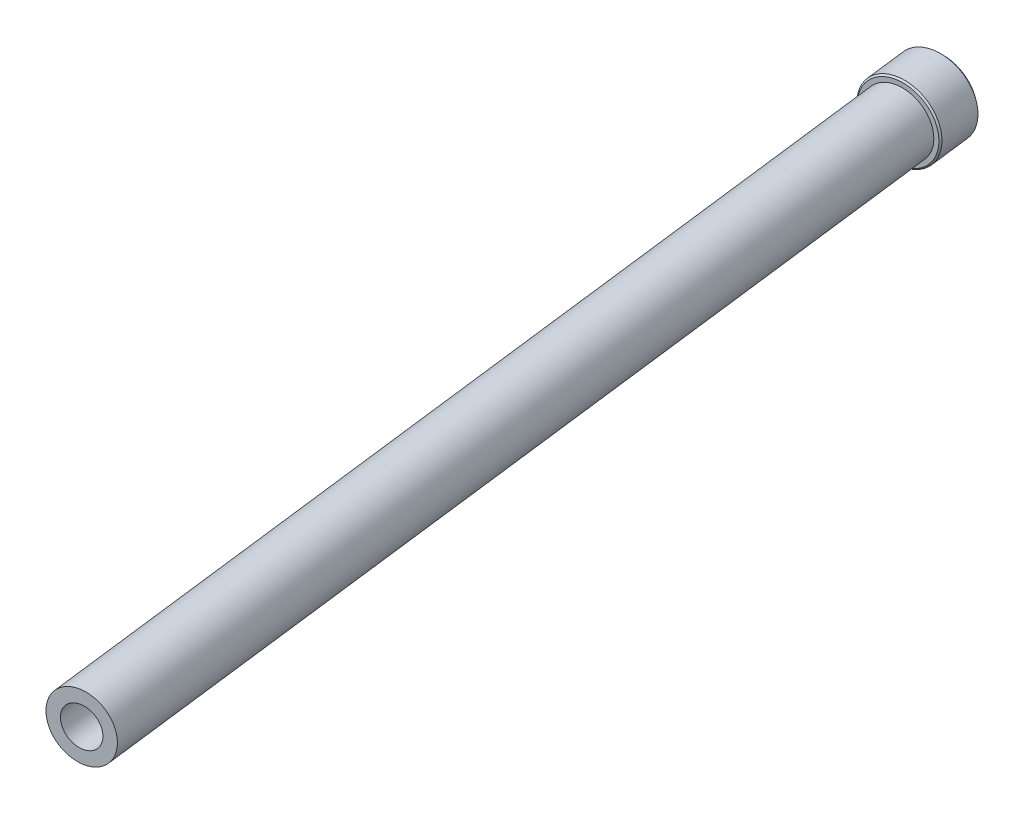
ISO-10303-21;
HEADER;
FILE_DESCRIPTION(('STEP AP214'),'2;1');
FILE_NAME('part.step','',(''),(''),'','','');
FILE_SCHEMA(('AUTOMOTIVE_DESIGN { 1 0 10303 214 1 1 1 1 }'));
ENDSEC;
DATA;
#1=APPLICATION_CONTEXT('core data for automotive mechanical design processes');
#2=APPLICATION_PROTOCOL_DEFINITION('international standard','automotive_design',2000,#1);
#3=PRODUCT_CONTEXT('',#1,'mechanical');
#4=PRODUCT('Part','Part','',(#3));
#5=PRODUCT_RELATED_PRODUCT_CATEGORY('part','',(#4));
#6=PRODUCT_DEFINITION_FORMATION('','',#4);
#7=PRODUCT_DEFINITION_CONTEXT('part definition',#1,'design');
#8=PRODUCT_DEFINITION('design','',#6,#7);
#9=PRODUCT_DEFINITION_SHAPE('','',#8);
#10=(LENGTH_UNIT() NAMED_UNIT(*) SI_UNIT(.MILLI.,.METRE.));
#11=(NAMED_UNIT(*) PLANE_ANGLE_UNIT() SI_UNIT($,.RADIAN.));
#12=(NAMED_UNIT(*) SI_UNIT($,.STERADIAN.) SOLID_ANGLE_UNIT());
#13=UNCERTAINTY_MEASURE_WITH_UNIT(LENGTH_MEASURE(1.E-05),#10,'distance_accuracy_value','');
#14=(GEOMETRIC_REPRESENTATION_CONTEXT(3) GLOBAL_UNCERTAINTY_ASSIGNED_CONTEXT((#13)) GLOBAL_UNIT_ASSIGNED_CONTEXT((#10,
#11,#12)) REPRESENTATION_CONTEXT('',''));
#15=CARTESIAN_POINT('',(0.,0.,0.));
#16=DIRECTION('',(0.,0.,1.));
#17=DIRECTION('',(1.,0.,0.));
#18=AXIS2_PLACEMENT_3D('',#15,#16,#17);
#19=CARTESIAN_POINT('',(8.47286332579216,-1.5482407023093E-13,-889.518716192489));
#20=DIRECTION('',(-0.122564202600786,0.,-0.992460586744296));
#21=DIRECTION('',(-0.992453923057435,0.00366450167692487,0.12256337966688));
#22=AXIS2_PLACEMENT_3D('',#19,#20,#21);
#23=CONICAL_SURFACE('',#22,24.,0.785398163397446);
#24=CARTESIAN_POINT('',(8.35029912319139,-1.55474591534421E-13,-890.511176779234));
#25=DIRECTION('',(0.122564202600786,0.,0.992460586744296));
#26=DIRECTION('',(0.992453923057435,-0.00366450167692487,-0.12256337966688));
#27=AXIS2_PLACEMENT_3D('',#24,#25,#26);
#28=CIRCLE('',#27,25.);
#29=CARTESIAN_POINT('',(-16.4610489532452,0.0916125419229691,-887.447092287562));
#30=VERTEX_POINT('',#29);
#31=EDGE_CURVE('E41',#30,#30,#28,.F.);
#32=CARTESIAN_POINT('',(8.47286332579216,-1.5482407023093E-13,-889.518716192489));
#33=DIRECTION('',(0.122564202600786,0.,0.992460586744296));
#34=DIRECTION('',(0.992453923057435,-0.00366450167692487,-0.12256337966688));
#35=AXIS2_PLACEMENT_3D('',#32,#33,#34);
#36=CIRCLE('',#35,24.);
#37=CARTESIAN_POINT('',(-15.3460308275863,0.0879480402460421,-886.577195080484));
#38=VERTEX_POINT('',#37);
#39=EDGE_CURVE('E34',#38,#38,#36,.T.);
#40=CARTESIAN_POINT('',(-16.4610489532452,0.0916125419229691,-887.447092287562));
#41=CARTESIAN_POINT('',(-16.4494341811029,0.0915743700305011,-887.438030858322));
#42=CARTESIAN_POINT('',(-16.4378194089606,0.0915361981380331,-887.428969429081));
#43=CARTESIAN_POINT('',(-16.4145898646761,0.0914598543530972,-887.4108465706));
#44=CARTESIAN_POINT('',(-16.4029750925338,0.0914216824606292,-887.40178514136));
#45=CARTESIAN_POINT('',(-16.3797455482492,0.0913453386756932,-887.383662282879));
#46=CARTESIAN_POINT('',(-16.3681307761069,0.0913071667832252,-887.374600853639));
#47=CARTESIAN_POINT('',(-16.3449012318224,0.0912308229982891,-887.356477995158));
#48=CARTESIAN_POINT('',(-16.3332864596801,0.0911926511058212,-887.347416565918));
#49=CARTESIAN_POINT('',(-16.3100569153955,0.0911163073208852,-887.329293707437));
#50=CARTESIAN_POINT('',(-16.2984421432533,0.0910781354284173,-887.320232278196));
#51=CARTESIAN_POINT('',(-16.2752125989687,0.0910017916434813,-887.302109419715));
#52=CARTESIAN_POINT('',(-16.2635978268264,0.0909636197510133,-887.293047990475));
#53=CARTESIAN_POINT('',(-16.2403682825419,0.0908872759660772,-887.274925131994));
#54=CARTESIAN_POINT('',(-16.2287535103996,0.0908491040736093,-887.265863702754));
#55=CARTESIAN_POINT('',(-16.205523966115,0.0907727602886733,-887.247740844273));
#56=CARTESIAN_POINT('',(-16.1939091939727,0.0907345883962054,-887.238679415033));
#57=CARTESIAN_POINT('',(-16.1706796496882,0.0906582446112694,-887.220556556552));
#58=CARTESIAN_POINT('',(-16.1590648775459,0.0906200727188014,-887.211495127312));
#59=CARTESIAN_POINT('',(-16.1358353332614,0.0905437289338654,-887.193372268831));
#60=CARTESIAN_POINT('',(-16.1242205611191,0.0905055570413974,-887.18431083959));
#61=CARTESIAN_POINT('',(-16.1009910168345,0.0904292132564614,-887.16618798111));
#62=CARTESIAN_POINT('',(-16.0893762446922,0.0903910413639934,-887.157126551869));
#63=CARTESIAN_POINT('',(-16.0661467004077,0.0903146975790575,-887.139003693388));
#64=CARTESIAN_POINT('',(-16.0545319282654,0.0902765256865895,-887.129942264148));
#65=CARTESIAN_POINT('',(-16.0313023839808,0.0902001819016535,-887.111819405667));
#66=CARTESIAN_POINT('',(-16.0196876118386,0.0901620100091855,-887.102757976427));
#67=CARTESIAN_POINT('',(-15.996458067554,0.0900856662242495,-887.084635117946));
#68=CARTESIAN_POINT('',(-15.9848432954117,0.0900474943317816,-887.075573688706));
#69=CARTESIAN_POINT('',(-15.9616137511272,0.0899711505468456,-887.057450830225));
#70=CARTESIAN_POINT('',(-15.9499989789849,0.0899329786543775,-887.048389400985));
#71=CARTESIAN_POINT('',(-15.9267694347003,0.0898566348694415,-887.030266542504));
#72=CARTESIAN_POINT('',(-15.915154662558,0.0898184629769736,-887.021205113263));
#73=CARTESIAN_POINT('',(-15.8919251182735,0.0897421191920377,-887.003082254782));
#74=CARTESIAN_POINT('',(-15.8803103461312,0.0897039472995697,-886.994020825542));
#75=CARTESIAN_POINT('',(-15.8570808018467,0.0896276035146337,-886.975897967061));
#76=CARTESIAN_POINT('',(-15.8454660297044,0.0895894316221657,-886.966836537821));
#77=CARTESIAN_POINT('',(-15.8222364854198,0.0895130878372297,-886.94871367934));
#78=CARTESIAN_POINT('',(-15.8106217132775,0.0894749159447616,-886.9396522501));
#79=CARTESIAN_POINT('',(-15.787392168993,0.0893985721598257,-886.921529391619));
#80=CARTESIAN_POINT('',(-15.7757773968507,0.0893604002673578,-886.912467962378));
#81=CARTESIAN_POINT('',(-15.7525478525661,0.0892840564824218,-886.894345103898));
#82=CARTESIAN_POINT('',(-15.7409330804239,0.0892458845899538,-886.885283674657));
#83=CARTESIAN_POINT('',(-15.7177035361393,0.0891695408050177,-886.867160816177));
#84=CARTESIAN_POINT('',(-15.706088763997,0.0891313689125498,-886.858099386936));
#85=CARTESIAN_POINT('',(-15.6828592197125,0.0890550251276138,-886.839976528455));
#86=CARTESIAN_POINT('',(-15.6712444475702,0.0890168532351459,-886.830915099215));
#87=CARTESIAN_POINT('',(-15.6480149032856,0.0889405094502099,-886.812792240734));
#88=CARTESIAN_POINT('',(-15.6364001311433,0.0889023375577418,-886.803730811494));
#89=CARTESIAN_POINT('',(-15.6131705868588,0.0888259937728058,-886.785607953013));
#90=CARTESIAN_POINT('',(-15.6015558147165,0.0887878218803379,-886.776546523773));
#91=CARTESIAN_POINT('',(-15.578326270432,0.088711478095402,-886.758423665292));
#92=CARTESIAN_POINT('',(-15.5667114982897,0.088673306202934,-886.749362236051));
#93=CARTESIAN_POINT('',(-15.5434819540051,0.088596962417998,-886.731239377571));
#94=CARTESIAN_POINT('',(-15.5318671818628,0.08855879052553,-886.72217794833));
#95=CARTESIAN_POINT('',(-15.5086376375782,0.088482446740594,-886.704055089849));
#96=CARTESIAN_POINT('',(-15.497022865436,0.0884442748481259,-886.694993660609));
#97=CARTESIAN_POINT('',(-15.4737933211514,0.08836793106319,-886.676870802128));
#98=CARTESIAN_POINT('',(-15.4621785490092,0.0883297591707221,-886.667809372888));
#99=CARTESIAN_POINT('',(-15.4389490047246,0.0882534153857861,-886.649686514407));
#100=CARTESIAN_POINT('',(-15.4273342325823,0.0882152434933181,-886.640625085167));
#101=CARTESIAN_POINT('',(-15.4041046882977,0.088138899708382,-886.622502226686));
#102=CARTESIAN_POINT('',(-15.3924899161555,0.0881007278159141,-886.613440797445));
#103=CARTESIAN_POINT('',(-15.3692603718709,0.0880243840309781,-886.595317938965));
#104=CARTESIAN_POINT('',(-15.3576455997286,0.0879862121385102,-886.586256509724));
#105=CARTESIAN_POINT('',(-15.3460308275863,0.0879480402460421,-886.577195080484));
#106=B_SPLINE_CURVE_WITH_KNOTS('',3,(#40,#41,#42,#43,#44,#45,#46,#47,#48,#49,#50,#51,#52,#53,
#54,#55,#56,#57,#58,#59,#60,#61,#62,#63,#64,#65,#66,#67,#68,#69,#70,#71,#72,#73,#74,#75,#76,#77,
#78,#79,#80,#81,#82,#83,#84,#85,#86,#87,#88,#89,#90,#91,#92,#93,#94,#95,#96,#97,#98,#99,#100,
#101,#102,#103,#104,#105),.UNSPECIFIED.,.F.,.F.,(4,2,2,2,2,2,2,2,2,2,2,2,2,2,2,2,2,2,2,2,2,2,2,
2,2,2,2,2,2,2,2,2,4),(0.,0.0441941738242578,0.08838834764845,0.132582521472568,
0.176776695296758,0.220970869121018,0.265165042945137,0.309359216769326,0.353553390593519,
0.397747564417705,0.441941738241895,0.486135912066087,0.530330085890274,0.574524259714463,
0.618718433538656,0.662912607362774,0.707106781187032,0.751300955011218,0.795495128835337,
0.839689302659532,0.883883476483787,0.928077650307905,0.9722718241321,1.01646599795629,
1.06066017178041,1.10485434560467,1.14904851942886,1.19324269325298,1.23743686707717,
1.28163104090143,1.32582521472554,1.37001938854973,1.41421356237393),.UNSPECIFIED.);
#107=EDGE_CURVE('BSEAM14',#30,#38,#106,.T.);
#108=ORIENTED_EDGE('',*,*,#31,.F.);
#109=ORIENTED_EDGE('',*,*,#39,.F.);
#110=ORIENTED_EDGE('',*,*,#107,.T.);
#111=ORIENTED_EDGE('',*,*,#107,.F.);
#112=EDGE_LOOP('',(#108,#110,#109,#111));
#113=FACE_BOUND('',#112,.T.);
#114=ADVANCED_FACE('F14',(#113),#23,.T.);
#115=CARTESIAN_POINT('',(8.47286332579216,-1.5482407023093E-13,-889.518716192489));
#116=DIRECTION('',(0.122564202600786,0.,0.992460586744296));
#117=DIRECTION('',(0.992453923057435,-0.00366450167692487,-0.12256337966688));
#118=AXIS2_PLACEMENT_3D('',#115,#116,#117);
#119=PLANE('',#118);
#120=ORIENTED_EDGE('',*,*,#39,.T.);
#121=EDGE_LOOP('',(#120));
#122=FACE_BOUND('',#121,.T.);
#123=CARTESIAN_POINT('',(8.47286332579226,-1.55257751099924E-13,-889.518716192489));
#124=DIRECTION('',(0.122564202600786,0.,0.992460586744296));
#125=DIRECTION('',(0.992453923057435,-0.00366450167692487,-0.12256337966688));
#126=AXIS2_PLACEMENT_3D('',#123,#124,#125);
#127=CIRCLE('',#126,21.);
#128=CARTESIAN_POINT('',(29.3143957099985,-0.0769545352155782,-892.092547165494));
#129=VERTEX_POINT('',#128);
#130=EDGE_CURVE('E9',#129,#129,#127,.F.);
#131=ORIENTED_EDGE('',*,*,#130,.T.);
#132=EDGE_LOOP('',(#131));
#133=FACE_BOUND('',#132,.T.);
#134=ADVANCED_FACE('F72',(#122,#133),#119,.T.);
#135=CARTESIAN_POINT('',(4.79593724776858,-1.53956708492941E-13,-919.292533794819));
#136=DIRECTION('',(0.122564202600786,0.,0.992460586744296));
#137=DIRECTION('',(0.992453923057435,-0.00366450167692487,-0.12256337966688));
#138=AXIS2_PLACEMENT_3D('',#135,#136,#137);
#139=CYLINDRICAL_SURFACE('',#138,25.);
#140=CARTESIAN_POINT('',(5.02513230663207,-1.53956708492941E-13,-917.436632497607));
#141=DIRECTION('',(-0.122564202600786,0.,-0.992460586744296));
#142=DIRECTION('',(-0.992453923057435,0.00366450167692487,0.12256337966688));
#143=AXIS2_PLACEMENT_3D('',#140,#141,#142);
#144=CIRCLE('',#143,25.);
#145=CARTESIAN_POINT('',(29.8364803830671,-0.0916125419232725,-920.500716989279));
#146=VERTEX_POINT('',#145);
#147=EDGE_CURVE('E18',#146,#146,#144,.F.);
#148=ORIENTED_EDGE('',*,*,#147,.T.);
#149=EDGE_LOOP('',(#148));
#150=FACE_BOUND('',#149,.T.);
#151=ORIENTED_EDGE('',*,*,#31,.T.);
#152=EDGE_LOOP('',(#151));
#153=FACE_BOUND('',#152,.T.);
#154=ADVANCED_FACE('F79',(#150,#153),#139,.T.);
#155=CARTESIAN_POINT('',(4.78000390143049,-1.53523027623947E-13,-919.421553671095));
#156=DIRECTION('',(-0.122564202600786,0.,-0.992460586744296));
#157=DIRECTION('',(-0.992453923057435,0.00366450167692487,0.12256337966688));
#158=AXIS2_PLACEMENT_3D('',#155,#156,#157);
#159=PLANE('',#158);
#160=CARTESIAN_POINT('',(4.78000390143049,-1.53523027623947E-13,-919.421553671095));
#161=DIRECTION('',(-0.122564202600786,0.,-0.992460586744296));
#162=DIRECTION('',(-0.992453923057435,0.00366450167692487,0.12256337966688));
#163=AXIS2_PLACEMENT_3D('',#160,#161,#162);
#164=CIRCLE('',#163,23.);
#165=CARTESIAN_POINT('',(27.6064441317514,-0.0842835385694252,-922.240511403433));
#166=VERTEX_POINT('',#165);
#167=EDGE_CURVE('E26',#166,#166,#164,.T.);
#168=ORIENTED_EDGE('',*,*,#167,.T.);
#169=EDGE_LOOP('',(#168));
#170=FACE_BOUND('',#169,.T.);
#171=CARTESIAN_POINT('',(4.78000390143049,-1.53523027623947E-13,-919.421553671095));
#172=DIRECTION('',(-0.122564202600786,0.,-0.992460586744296));
#173=DIRECTION('',(-0.992453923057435,0.00366450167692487,0.12256337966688));
#174=AXIS2_PLACEMENT_3D('',#171,#172,#173);
#175=CIRCLE('',#174,7.5);
#176=CARTESIAN_POINT('',(12.2234083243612,-0.0274837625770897,-920.340779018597));
#177=VERTEX_POINT('',#176);
#178=EDGE_CURVE('E31',#177,#177,#175,.T.);
#179=ORIENTED_EDGE('',*,*,#178,.F.);
#180=EDGE_LOOP('',(#179));
#181=FACE_BOUND('',#180,.T.);
#182=ADVANCED_FACE('F51',(#170,#181),#159,.T.);
#183=CARTESIAN_POINT('',(8.47286332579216,-1.5482407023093E-13,-889.518716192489));
#184=DIRECTION('',(0.122564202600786,0.,0.992460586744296));
#185=DIRECTION('',(0.992453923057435,-0.00366450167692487,-0.12256337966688));
#186=AXIS2_PLACEMENT_3D('',#183,#184,#185);
#187=CYLINDRICAL_SURFACE('',#186,7.5);
#188=CARTESIAN_POINT('',(4.35102919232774,-1.53523027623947E-13,-922.8951657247));
#189=DIRECTION('',(-0.122564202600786,0.,-0.992460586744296));
#190=DIRECTION('',(-0.992453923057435,0.00366450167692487,0.12256337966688));
#191=AXIS2_PLACEMENT_3D('',#188,#189,#190);
#192=CIRCLE('',#191,7.5);
#193=CARTESIAN_POINT('',(11.7944336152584,-0.0274837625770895,-923.814391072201));
#194=VERTEX_POINT('',#193);
#195=EDGE_CURVE('E28',#194,#194,#192,.T.);
#196=CARTESIAN_POINT('',(12.2234083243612,-0.0274837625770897,-920.340779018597));
#197=CARTESIAN_POINT('',(12.2189398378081,-0.0274837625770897,-920.376962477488));
#198=CARTESIAN_POINT('',(12.2144713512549,-0.0274837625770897,-920.41314593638));
#199=CARTESIAN_POINT('',(12.2055343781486,-0.0274837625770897,-920.485512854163));
#200=CARTESIAN_POINT('',(12.2010658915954,-0.0274837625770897,-920.521696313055));
#201=CARTESIAN_POINT('',(12.1921289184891,-0.0274837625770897,-920.594063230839));
#202=CARTESIAN_POINT('',(12.187660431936,-0.0274837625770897,-920.63024668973));
#203=CARTESIAN_POINT('',(12.1787234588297,-0.0274837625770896,-920.702613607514));
#204=CARTESIAN_POINT('',(12.1742549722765,-0.0274837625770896,-920.738797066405));
#205=CARTESIAN_POINT('',(12.1653179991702,-0.0274837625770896,-920.811163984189));
#206=CARTESIAN_POINT('',(12.160849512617,-0.0274837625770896,-920.847347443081));
#207=CARTESIAN_POINT('',(12.1519125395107,-0.0274837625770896,-920.919714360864));
#208=CARTESIAN_POINT('',(12.1474440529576,-0.0274837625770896,-920.955897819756));
#209=CARTESIAN_POINT('',(12.1385070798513,-0.0274837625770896,-921.028264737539));
#210=CARTESIAN_POINT('',(12.1340385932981,-0.0274837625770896,-921.064448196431));
#211=CARTESIAN_POINT('',(12.1251016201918,-0.0274837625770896,-921.136815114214));
#212=CARTESIAN_POINT('',(12.1206331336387,-0.0274837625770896,-921.172998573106));
#213=CARTESIAN_POINT('',(12.1116961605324,-0.0274837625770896,-921.24536549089));
#214=CARTESIAN_POINT('',(12.1072276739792,-0.0274837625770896,-921.281548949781));
#215=CARTESIAN_POINT('',(12.0982907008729,-0.0274837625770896,-921.353915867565));
#216=CARTESIAN_POINT('',(12.0938222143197,-0.0274837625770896,-921.390099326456));
#217=CARTESIAN_POINT('',(12.0848852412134,-0.0274837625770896,-921.46246624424));
#218=CARTESIAN_POINT('',(12.0804167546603,-0.0274837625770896,-921.498649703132));
#219=CARTESIAN_POINT('',(12.071479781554,-0.0274837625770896,-921.571016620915));
#220=CARTESIAN_POINT('',(12.0670112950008,-0.0274837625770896,-921.607200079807));
#221=CARTESIAN_POINT('',(12.0580743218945,-0.0274837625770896,-921.67956699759));
#222=CARTESIAN_POINT('',(12.0536058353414,-0.0274837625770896,-921.715750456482));
#223=CARTESIAN_POINT('',(12.0446688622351,-0.0274837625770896,-921.788117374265));
#224=CARTESIAN_POINT('',(12.0402003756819,-0.0274837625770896,-921.824300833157));
#225=CARTESIAN_POINT('',(12.0312634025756,-0.0274837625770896,-921.89666775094));
#226=CARTESIAN_POINT('',(12.0267949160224,-0.0274837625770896,-921.932851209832));
#227=CARTESIAN_POINT('',(12.0178579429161,-0.0274837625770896,-922.005218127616));
#228=CARTESIAN_POINT('',(12.013389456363,-0.0274837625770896,-922.041401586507));
#229=CARTESIAN_POINT('',(12.0044524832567,-0.0274837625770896,-922.113768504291));
#230=CARTESIAN_POINT('',(11.9999839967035,-0.0274837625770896,-922.149951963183));
#231=CARTESIAN_POINT('',(11.9910470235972,-0.0274837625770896,-922.222318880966));
#232=CARTESIAN_POINT('',(11.9865785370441,-0.0274837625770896,-922.258502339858));
#233=CARTESIAN_POINT('',(11.9776415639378,-0.0274837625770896,-922.330869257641));
#234=CARTESIAN_POINT('',(11.9731730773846,-0.0274837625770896,-922.367052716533));
#235=CARTESIAN_POINT('',(11.9642361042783,-0.0274837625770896,-922.439419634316));
#236=CARTESIAN_POINT('',(11.9597676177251,-0.0274837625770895,-922.475603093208));
#237=CARTESIAN_POINT('',(11.9508306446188,-0.0274837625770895,-922.547970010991));
#238=CARTESIAN_POINT('',(11.9463621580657,-0.0274837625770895,-922.584153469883));
#239=CARTESIAN_POINT('',(11.9374251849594,-0.0274837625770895,-922.656520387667));
#240=CARTESIAN_POINT('',(11.9329566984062,-0.0274837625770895,-922.692703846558));
#241=CARTESIAN_POINT('',(11.9240197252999,-0.0274837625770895,-922.765070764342));
#242=CARTESIAN_POINT('',(11.9195512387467,-0.0274837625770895,-922.801254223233));
#243=CARTESIAN_POINT('',(11.9106142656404,-0.0274837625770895,-922.873621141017));
#244=CARTESIAN_POINT('',(11.9061457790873,-0.0274837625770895,-922.909804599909));
#245=CARTESIAN_POINT('',(11.897208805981,-0.0274837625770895,-922.982171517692));
#246=CARTESIAN_POINT('',(11.8927403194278,-0.0274837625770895,-923.018354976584));
#247=CARTESIAN_POINT('',(11.8838033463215,-0.0274837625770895,-923.090721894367));
#248=CARTESIAN_POINT('',(11.8793348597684,-0.0274837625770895,-923.126905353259));
#249=CARTESIAN_POINT('',(11.8703978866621,-0.0274837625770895,-923.199272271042));
#250=CARTESIAN_POINT('',(11.8659294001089,-0.0274837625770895,-923.235455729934));
#251=CARTESIAN_POINT('',(11.8569924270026,-0.0274837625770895,-923.307822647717));
#252=CARTESIAN_POINT('',(11.8525239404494,-0.0274837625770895,-923.344006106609));
#253=CARTESIAN_POINT('',(11.8435869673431,-0.0274837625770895,-923.416373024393));
#254=CARTESIAN_POINT('',(11.83911848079,-0.0274837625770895,-923.452556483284));
#255=CARTESIAN_POINT('',(11.8301815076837,-0.0274837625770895,-923.524923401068));
#256=CARTESIAN_POINT('',(11.8257130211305,-0.0274837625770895,-923.56110685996));
#257=CARTESIAN_POINT('',(11.8167760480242,-0.0274837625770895,-923.633473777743));
#258=CARTESIAN_POINT('',(11.8123075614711,-0.0274837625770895,-923.669657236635));
#259=CARTESIAN_POINT('',(11.8033705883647,-0.0274837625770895,-923.742024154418));
#260=CARTESIAN_POINT('',(11.7989021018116,-0.0274837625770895,-923.77820761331));
#261=CARTESIAN_POINT('',(11.7944336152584,-0.0274837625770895,-923.814391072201));
#262=B_SPLINE_CURVE_WITH_KNOTS('',3,(#196,#197,#198,#199,#200,#201,#202,#203,#204,#205,#206,
#207,#208,#209,#210,#211,#212,#213,#214,#215,#216,#217,#218,#219,#220,#221,#222,#223,#224,#225,
#226,#227,#228,#229,#230,#231,#232,#233,#234,#235,#236,#237,#238,#239,#240,#241,#242,#243,#244,
#245,#246,#247,#248,#249,#250,#251,#252,#253,#254,#255,#256,#257,#258,#259,#260,#261),
.UNSPECIFIED.,.F.,.F.,(4,2,2,2,2,2,2,2,2,2,2,2,2,2,2,2,2,2,2,2,2,2,2,2,2,2,2,2,2,2,2,2,4),(0.,
0.109374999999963,0.218749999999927,0.328125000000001,0.437499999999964,0.546874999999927,
0.656250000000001,0.765624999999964,0.874999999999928,0.984375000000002,1.09374999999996,
1.20312499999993,1.3125,1.42187499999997,1.53124999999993,1.640625,1.74999999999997,
1.85937499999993,1.96875,2.07812499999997,2.18749999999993,2.296875,2.40624999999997,
2.51562499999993,2.625,2.73437499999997,2.84374999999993,2.953125,3.06249999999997,
3.17187499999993,3.28125,3.39062499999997,3.49999999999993),.UNSPECIFIED.);
#263=EDGE_CURVE('BSEAM67',#177,#194,#262,.T.);
#264=ORIENTED_EDGE('',*,*,#178,.T.);
#265=ORIENTED_EDGE('',*,*,#195,.F.);
#266=ORIENTED_EDGE('',*,*,#263,.T.);
#267=ORIENTED_EDGE('',*,*,#263,.F.);
#268=EDGE_LOOP('',(#264,#266,#265,#267));
#269=FACE_BOUND('',#268,.T.);
#270=ADVANCED_FACE('F67',(#269),#187,.T.);
#271=CARTESIAN_POINT('',(4.35102919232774,-1.53523027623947E-13,-922.8951657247));
#272=DIRECTION('',(-0.122564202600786,0.,-0.992460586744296));
#273=DIRECTION('',(-0.992453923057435,0.00366450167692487,0.12256337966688));
#274=AXIS2_PLACEMENT_3D('',#271,#272,#273);
#275=PLANE('',#274);
#276=ORIENTED_EDGE('',*,*,#195,.T.);
#277=EDGE_LOOP('',(#276));
#278=FACE_BOUND('',#277,.T.);
#279=ADVANCED_FACE('F56',(#278),#275,.T.);
#280=CARTESIAN_POINT('',(4.78000390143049,-1.53523027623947E-13,-919.421553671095));
#281=DIRECTION('',(0.122564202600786,0.,0.992460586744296));
#282=DIRECTION('',(0.992453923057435,-0.00366450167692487,-0.12256337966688));
#283=AXIS2_PLACEMENT_3D('',#280,#281,#282);
#284=CONICAL_SURFACE('',#283,23.,0.785398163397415);
#285=CARTESIAN_POINT('',(29.8364803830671,-0.0916125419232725,-920.500716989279));
#286=CARTESIAN_POINT('',(29.8132508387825,-0.0915361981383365,-920.51883984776));
#287=CARTESIAN_POINT('',(29.790021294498,-0.0914598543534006,-920.53696270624));
#288=CARTESIAN_POINT('',(29.743562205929,-0.0913071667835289,-920.573208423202));
#289=CARTESIAN_POINT('',(29.7203326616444,-0.091230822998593,-920.591331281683));
#290=CARTESIAN_POINT('',(29.6738735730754,-0.0910781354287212,-920.627576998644));
#291=CARTESIAN_POINT('',(29.6506440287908,-0.0910017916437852,-920.645699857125));
#292=CARTESIAN_POINT('',(29.6041849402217,-0.0908491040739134,-920.681945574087));
#293=CARTESIAN_POINT('',(29.5809553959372,-0.0907727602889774,-920.700068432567));
#294=CARTESIAN_POINT('',(29.5344963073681,-0.0906200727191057,-920.736314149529));
#295=CARTESIAN_POINT('',(29.5112667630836,-0.0905437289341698,-920.75443700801));
#296=CARTESIAN_POINT('',(29.4648076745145,-0.090391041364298,-920.790682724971));
#297=CARTESIAN_POINT('',(29.44157813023,-0.0903146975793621,-920.808805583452));
#298=CARTESIAN_POINT('',(29.3951190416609,-0.0901620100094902,-920.845051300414));
#299=CARTESIAN_POINT('',(29.3718894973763,-0.0900856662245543,-920.863174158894));
#300=CARTESIAN_POINT('',(29.3254304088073,-0.0899329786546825,-920.899419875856));
#301=CARTESIAN_POINT('',(29.3022008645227,-0.0898566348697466,-920.917542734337));
#302=CARTESIAN_POINT('',(29.2557417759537,-0.0897039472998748,-920.953788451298));
#303=CARTESIAN_POINT('',(29.2325122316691,-0.0896276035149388,-920.971911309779));
#304=CARTESIAN_POINT('',(29.1860531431,-0.089474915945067,-921.00815702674));
#305=CARTESIAN_POINT('',(29.1628235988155,-0.0893985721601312,-921.026279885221));
#306=CARTESIAN_POINT('',(29.1163645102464,-0.0892458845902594,-921.062525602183));
#307=CARTESIAN_POINT('',(29.0931349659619,-0.0891695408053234,-921.080648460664));
#308=CARTESIAN_POINT('',(29.0466758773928,-0.0890168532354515,-921.116894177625));
#309=CARTESIAN_POINT('',(29.0234463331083,-0.0889405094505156,-921.135017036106));
#310=CARTESIAN_POINT('',(28.9769872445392,-0.0887878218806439,-921.171262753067));
#311=CARTESIAN_POINT('',(28.9537577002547,-0.088711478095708,-921.189385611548));
#312=CARTESIAN_POINT('',(28.9072986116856,-0.0885587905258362,-921.22563132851));
#313=CARTESIAN_POINT('',(28.884069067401,-0.0884824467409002,-921.243754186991));
#314=CARTESIAN_POINT('',(28.837609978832,-0.0883297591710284,-921.279999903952));
#315=CARTESIAN_POINT('',(28.8143804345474,-0.0882534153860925,-921.298122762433));
#316=CARTESIAN_POINT('',(28.7679213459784,-0.0881007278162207,-921.334368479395));
#317=CARTESIAN_POINT('',(28.7446918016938,-0.0880243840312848,-921.352491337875));
#318=CARTESIAN_POINT('',(28.6982327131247,-0.0878716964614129,-921.388737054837));
#319=CARTESIAN_POINT('',(28.6750031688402,-0.087795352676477,-921.406859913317));
#320=CARTESIAN_POINT('',(28.6285440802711,-0.0876426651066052,-921.443105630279));
#321=CARTESIAN_POINT('',(28.6053145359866,-0.0875663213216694,-921.46122848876));
#322=CARTESIAN_POINT('',(28.5588554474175,-0.0874136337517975,-921.497474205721));
#323=CARTESIAN_POINT('',(28.535625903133,-0.0873372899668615,-921.515597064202));
#324=CARTESIAN_POINT('',(28.4891668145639,-0.0871846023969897,-921.551842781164));
#325=CARTESIAN_POINT('',(28.4659372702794,-0.0871082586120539,-921.569965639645));
#326=CARTESIAN_POINT('',(28.4194781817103,-0.0869555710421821,-921.606211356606));
#327=CARTESIAN_POINT('',(28.3962486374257,-0.0868792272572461,-921.624334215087));
#328=CARTESIAN_POINT('',(28.3497895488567,-0.0867265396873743,-921.660579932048));
#329=CARTESIAN_POINT('',(28.3265600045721,-0.0866501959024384,-921.678702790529));
#330=CARTESIAN_POINT('',(28.280100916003,-0.0864975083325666,-921.714948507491));
#331=CARTESIAN_POINT('',(28.2568713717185,-0.0864211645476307,-921.733071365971));
#332=CARTESIAN_POINT('',(28.2104122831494,-0.0862684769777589,-921.769317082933));
#333=CARTESIAN_POINT('',(28.1871827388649,-0.0861921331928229,-921.787439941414));
#334=CARTESIAN_POINT('',(28.1407236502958,-0.0860394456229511,-921.823685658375));
#335=CARTESIAN_POINT('',(28.1174941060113,-0.0859631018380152,-921.841808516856));
#336=CARTESIAN_POINT('',(28.0710350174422,-0.0858104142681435,-921.878054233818));
#337=CARTESIAN_POINT('',(28.0478054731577,-0.0857340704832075,-921.896177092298));
#338=CARTESIAN_POINT('',(28.0013463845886,-0.0855813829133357,-921.93242280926));
#339=CARTESIAN_POINT('',(27.978116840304,-0.0855050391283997,-921.950545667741));
#340=CARTESIAN_POINT('',(27.931657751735,-0.0853523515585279,-921.986791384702));
#341=CARTESIAN_POINT('',(27.9084282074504,-0.0852760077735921,-922.004914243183));
#342=CARTESIAN_POINT('',(27.8619691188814,-0.0851233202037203,-922.041159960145));
#343=CARTESIAN_POINT('',(27.8387395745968,-0.0850469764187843,-922.059282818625));
#344=CARTESIAN_POINT('',(27.7922804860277,-0.0848942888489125,-922.095528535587));
#345=CARTESIAN_POINT('',(27.7690509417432,-0.0848179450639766,-922.113651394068));
#346=CARTESIAN_POINT('',(27.7225918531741,-0.0846652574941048,-922.149897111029));
#347=CARTESIAN_POINT('',(27.6993623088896,-0.0845889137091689,-922.16801996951));
#348=CARTESIAN_POINT('',(27.6529032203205,-0.084436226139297,-922.204265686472));
#349=CARTESIAN_POINT('',(27.6296736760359,-0.084359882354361,-922.222388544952));
#350=CARTESIAN_POINT('',(27.6064441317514,-0.0842835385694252,-922.240511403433));
#351=B_SPLINE_CURVE_WITH_KNOTS('',3,(#285,#286,#287,#288,#289,#290,#291,#292,#293,#294,#295,
#296,#297,#298,#299,#300,#301,#302,#303,#304,#305,#306,#307,#308,#309,#310,#311,#312,#313,#314,
#315,#316,#317,#318,#319,#320,#321,#322,#323,#324,#325,#326,#327,#328,#329,#330,#331,#332,#333,
#334,#335,#336,#337,#338,#339,#340,#341,#342,#343,#344,#345,#346,#347,#348,#349,#350),
.UNSPECIFIED.,.F.,.F.,(4,2,2,2,2,2,2,2,2,2,2,2,2,2,2,2,2,2,2,2,2,2,2,2,2,2,2,2,2,2,2,2,4),(0.,
0.0883883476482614,0.176776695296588,0.265165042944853,0.353553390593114,0.441941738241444,
0.530330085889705,0.618718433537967,0.707106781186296,0.795495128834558,0.883883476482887,
0.972271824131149,1.06066017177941,1.14904851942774,1.237436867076,1.32582521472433,
1.41421356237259,1.50260191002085,1.59099025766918,1.67937860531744,1.76776695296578,
1.85615530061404,1.9445436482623,2.03293199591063,2.12132034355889,2.20970869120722,
2.29809703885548,2.38648538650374,2.47487373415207,2.56326208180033,2.65165042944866,
2.74003877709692,2.82842712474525),.UNSPECIFIED.);
#352=EDGE_CURVE('BSEAM16',#146,#166,#351,.T.);
#353=ORIENTED_EDGE('',*,*,#147,.F.);
#354=ORIENTED_EDGE('',*,*,#167,.F.);
#355=ORIENTED_EDGE('',*,*,#352,.T.);
#356=ORIENTED_EDGE('',*,*,#352,.F.);
#357=EDGE_LOOP('',(#353,#355,#354,#356));
#358=FACE_BOUND('',#357,.T.);
#359=ADVANCED_FACE('F16',(#358),#284,.T.);
#360=CARTESIAN_POINT('',(6.02157927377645,-1.53739868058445E-13,-909.367927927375));
#361=DIRECTION('',(-0.122564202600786,0.,-0.992460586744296));
#362=DIRECTION('',(-0.992453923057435,0.00366450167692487,0.12256337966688));
#363=AXIS2_PLACEMENT_3D('',#360,#361,#362);
#364=PLANE('',#363);
#365=CARTESIAN_POINT('',(6.02157927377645,-1.53739868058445E-13,-909.367927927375));
#366=DIRECTION('',(-0.122564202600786,0.,-0.992460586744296));
#367=DIRECTION('',(-0.992453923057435,0.00366450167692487,0.12256337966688));
#368=AXIS2_PLACEMENT_3D('',#365,#366,#367);
#369=CIRCLE('',#368,12.5);
#370=CARTESIAN_POINT('',(6.06704019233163,12.4999160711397,-909.37354213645));
#371=VERTEX_POINT('',#370);
#372=EDGE_CURVE('E35',#371,#371,#369,.F.);
#373=ORIENTED_EDGE('',*,*,#372,.T.);
#374=EDGE_LOOP('',(#373));
#375=FACE_BOUND('',#374,.T.);
#376=ADVANCED_FACE('F55',(#375),#364,.F.);
#377=CARTESIAN_POINT('',(76.4959957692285,-1.86916454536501E-13,-338.703090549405));
#378=DIRECTION('',(0.122564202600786,0.,0.992460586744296));
#379=DIRECTION('',(0.00363687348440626,0.999993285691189,-0.000449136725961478));
#380=AXIS2_PLACEMENT_3D('',#377,#378,#379);
#381=CYLINDRICAL_SURFACE('',#380,12.5);
#382=CARTESIAN_POINT('',(83.8498479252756,-1.89301699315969E-13,-279.155455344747));
#383=DIRECTION('',(-0.122564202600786,0.,-0.992460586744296));
#384=DIRECTION('',(-0.992453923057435,0.00366450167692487,0.12256337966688));
#385=AXIS2_PLACEMENT_3D('',#382,#383,#384);
#386=CIRCLE('',#385,12.5);
#387=CARTESIAN_POINT('',(83.8953088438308,12.4999160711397,-279.161069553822));
#388=VERTEX_POINT('',#387);
#389=EDGE_CURVE('E38',#388,#388,#386,.T.);
#390=CARTESIAN_POINT('',(83.8953088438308,12.4999160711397,-279.161069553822));
#391=CARTESIAN_POINT('',(83.0845977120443,12.4999160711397,-285.725782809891));
#392=CARTESIAN_POINT('',(82.2738865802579,12.4999160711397,-292.29049606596));
#393=CARTESIAN_POINT('',(80.652464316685,12.4999160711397,-305.419922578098));
#394=CARTESIAN_POINT('',(79.8417531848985,12.4999160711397,-311.984635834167));
#395=CARTESIAN_POINT('',(78.2203309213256,12.4999160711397,-325.114062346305));
#396=CARTESIAN_POINT('',(77.4096197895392,12.4999160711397,-331.678775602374));
#397=CARTESIAN_POINT('',(75.7881975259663,12.4999160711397,-344.808202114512));
#398=CARTESIAN_POINT('',(74.9774863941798,12.4999160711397,-351.372915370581));
#399=CARTESIAN_POINT('',(73.3560641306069,12.4999160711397,-364.502341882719));
#400=CARTESIAN_POINT('',(72.5453529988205,12.4999160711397,-371.067055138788));
#401=CARTESIAN_POINT('',(70.9239307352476,12.4999160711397,-384.196481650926));
#402=CARTESIAN_POINT('',(70.1132196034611,12.4999160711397,-390.761194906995));
#403=CARTESIAN_POINT('',(68.4917973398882,12.4999160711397,-403.890621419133));
#404=CARTESIAN_POINT('',(67.6810862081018,12.4999160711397,-410.455334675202));
#405=CARTESIAN_POINT('',(66.0596639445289,12.4999160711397,-423.584761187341));
#406=CARTESIAN_POINT('',(65.2489528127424,12.4999160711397,-430.14947444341));
#407=CARTESIAN_POINT('',(63.6275305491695,12.4999160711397,-443.278900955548));
#408=CARTESIAN_POINT('',(62.8168194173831,12.4999160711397,-449.843614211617));
#409=CARTESIAN_POINT('',(61.1953971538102,12.4999160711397,-462.973040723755));
#410=CARTESIAN_POINT('',(60.3846860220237,12.4999160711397,-469.537753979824));
#411=CARTESIAN_POINT('',(58.7632637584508,12.4999160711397,-482.667180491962));
#412=CARTESIAN_POINT('',(57.9525526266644,12.4999160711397,-489.231893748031));
#413=CARTESIAN_POINT('',(56.3311303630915,12.4999160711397,-502.361320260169));
#414=CARTESIAN_POINT('',(55.520419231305,12.4999160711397,-508.926033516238));
#415=CARTESIAN_POINT('',(53.8989969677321,12.4999160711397,-522.055460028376));
#416=CARTESIAN_POINT('',(53.0882858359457,12.4999160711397,-528.620173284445));
#417=CARTESIAN_POINT('',(51.4668635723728,12.4999160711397,-541.749599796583));
#418=CARTESIAN_POINT('',(50.6561524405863,12.4999160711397,-548.314313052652));
#419=CARTESIAN_POINT('',(49.0347301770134,12.4999160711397,-561.44373956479));
#420=CARTESIAN_POINT('',(48.224019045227,12.4999160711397,-568.00845282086));
#421=CARTESIAN_POINT('',(46.6025967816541,12.4999160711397,-581.137879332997));
#422=CARTESIAN_POINT('',(45.7918856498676,12.4999160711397,-587.702592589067));
#423=CARTESIAN_POINT('',(44.1704633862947,12.4999160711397,-600.832019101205));
#424=CARTESIAN_POINT('',(43.3597522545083,12.4999160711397,-607.396732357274));
#425=CARTESIAN_POINT('',(41.7383299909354,12.4999160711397,-620.526158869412));
#426=CARTESIAN_POINT('',(40.9276188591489,12.4999160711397,-627.090872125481));
#427=CARTESIAN_POINT('',(39.306196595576,12.4999160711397,-640.220298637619));
#428=CARTESIAN_POINT('',(38.4954854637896,12.4999160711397,-646.785011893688));
#429=CARTESIAN_POINT('',(36.8740632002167,12.4999160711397,-659.914438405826));
#430=CARTESIAN_POINT('',(36.0633520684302,12.4999160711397,-666.479151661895));
#431=CARTESIAN_POINT('',(34.4419298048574,12.4999160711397,-679.608578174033));
#432=CARTESIAN_POINT('',(33.6312186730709,12.4999160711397,-686.173291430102));
#433=CARTESIAN_POINT('',(32.009796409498,12.4999160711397,-699.30271794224));
#434=CARTESIAN_POINT('',(31.1990852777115,12.4999160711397,-705.867431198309));
#435=CARTESIAN_POINT('',(29.5776630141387,12.4999160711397,-718.996857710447));
#436=CARTESIAN_POINT('',(28.7669518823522,12.4999160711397,-725.561570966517));
#437=CARTESIAN_POINT('',(27.1455296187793,12.4999160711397,-738.690997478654));
#438=CARTESIAN_POINT('',(26.3348184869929,12.4999160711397,-745.255710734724));
#439=CARTESIAN_POINT('',(24.71339622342,12.4999160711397,-758.385137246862));
#440=CARTESIAN_POINT('',(23.9026850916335,12.4999160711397,-764.949850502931));
#441=CARTESIAN_POINT('',(22.2812628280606,12.4999160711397,-778.079277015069));
#442=CARTESIAN_POINT('',(21.4705516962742,12.4999160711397,-784.643990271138));
#443=CARTESIAN_POINT('',(19.8491294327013,12.4999160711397,-797.773416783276));
#444=CARTESIAN_POINT('',(19.0384183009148,12.4999160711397,-804.338130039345));
#445=CARTESIAN_POINT('',(17.4169960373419,12.4999160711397,-817.467556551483));
#446=CARTESIAN_POINT('',(16.6062849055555,12.4999160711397,-824.032269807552));
#447=CARTESIAN_POINT('',(14.9848626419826,12.4999160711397,-837.16169631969));
#448=CARTESIAN_POINT('',(14.1741515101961,12.4999160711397,-843.726409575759));
#449=CARTESIAN_POINT('',(12.5527292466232,12.4999160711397,-856.855836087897));
#450=CARTESIAN_POINT('',(11.7420181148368,12.4999160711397,-863.420549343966));
#451=CARTESIAN_POINT('',(10.1205958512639,12.4999160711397,-876.549975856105));
#452=CARTESIAN_POINT('',(9.30988471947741,12.4999160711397,-883.114689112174));
#453=CARTESIAN_POINT('',(7.68846245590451,12.4999160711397,-896.244115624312));
#454=CARTESIAN_POINT('',(6.87775132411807,12.4999160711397,-902.808828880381));
#455=CARTESIAN_POINT('',(6.06704019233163,12.4999160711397,-909.37354213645));
#456=B_SPLINE_CURVE_WITH_KNOTS('',3,(#390,#391,#392,#393,#394,#395,#396,#397,#398,#399,#400,
#401,#402,#403,#404,#405,#406,#407,#408,#409,#410,#411,#412,#413,#414,#415,#416,#417,#418,#419,
#420,#421,#422,#423,#424,#425,#426,#427,#428,#429,#430,#431,#432,#433,#434,#435,#436,#437,#438,
#439,#440,#441,#442,#443,#444,#445,#446,#447,#448,#449,#450,#451,#452,#453,#454,#455),
.UNSPECIFIED.,.F.,.F.,(4,2,2,2,2,2,2,2,2,2,2,2,2,2,2,2,2,2,2,2,2,2,2,2,2,2,2,2,2,2,2,2,4),(0.,
19.84375,39.6874999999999,59.53125,79.3749999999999,99.2187499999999,119.0625,138.90625,158.75,
178.59375,198.4375,218.28125,238.125,257.96875,277.8125,297.65625,317.5,337.34375,357.1875,
377.03125,396.875,416.71875,436.5625,456.40625,476.25,496.09375,515.9375,535.78125,555.625,
575.46875,595.3125,615.15625,635.),.UNSPECIFIED.);
#457=EDGE_CURVE('BSEAM64',#388,#371,#456,.T.);
#458=ORIENTED_EDGE('',*,*,#389,.F.);
#459=ORIENTED_EDGE('',*,*,#372,.F.);
#460=ORIENTED_EDGE('',*,*,#457,.T.);
#461=ORIENTED_EDGE('',*,*,#457,.F.);
#462=EDGE_LOOP('',(#458,#460,#459,#461));
#463=FACE_BOUND('',#462,.T.);
#464=ADVANCED_FACE('F64',(#463),#381,.F.);
#465=CARTESIAN_POINT('',(83.9153116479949,17.9998791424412,-279.163539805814));
#466=DIRECTION('',(0.122564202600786,0.,0.992460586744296));
#467=DIRECTION('',(0.992453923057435,-0.00366450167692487,-0.12256337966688));
#468=AXIS2_PLACEMENT_3D('',#465,#466,#467);
#469=PLANE('',#468);
#470=CARTESIAN_POINT('',(83.8498479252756,-1.89301699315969E-13,-279.155455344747));
#471=DIRECTION('',(0.122564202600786,0.,0.992460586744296));
#472=DIRECTION('',(0.992453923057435,-0.00366450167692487,-0.12256337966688));
#473=AXIS2_PLACEMENT_3D('',#470,#471,#472);
#474=CIRCLE('',#473,21.);
#475=CARTESIAN_POINT('',(104.691380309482,-0.0769545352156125,-281.729286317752));
#476=VERTEX_POINT('',#475);
#477=EDGE_CURVE('E44',#476,#476,#474,.T.);
#478=ORIENTED_EDGE('',*,*,#477,.T.);
#479=EDGE_LOOP('',(#478));
#480=FACE_BOUND('',#479,.T.);
#481=ORIENTED_EDGE('',*,*,#389,.T.);
#482=EDGE_LOOP('',(#481));
#483=FACE_BOUND('',#482,.T.);
#484=ADVANCED_FACE('F89',(#480,#483),#469,.T.);
#485=CARTESIAN_POINT('',(-1.38092714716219,-1.51571463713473E-13,-969.309539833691));
#486=DIRECTION('',(0.122564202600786,0.,0.992460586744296));
#487=DIRECTION('',(0.992453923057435,-0.00366450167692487,-0.12256337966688));
#488=AXIS2_PLACEMENT_3D('',#485,#486,#487);
#489=CYLINDRICAL_SURFACE('',#488,21.);
#490=CARTESIAN_POINT('',(29.3143957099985,-0.0769545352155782,-892.092547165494));
#491=CARTESIAN_POINT('',(30.0995726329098,-0.0769545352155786,-885.734596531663));
#492=CARTESIAN_POINT('',(30.8847495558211,-0.0769545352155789,-879.376645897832));
#493=CARTESIAN_POINT('',(32.4551034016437,-0.0769545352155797,-866.660744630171));
#494=CARTESIAN_POINT('',(33.240280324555,-0.07695453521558,-860.30279399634));
#495=CARTESIAN_POINT('',(34.8106341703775,-0.0769545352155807,-847.586892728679));
#496=CARTESIAN_POINT('',(35.5958110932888,-0.0769545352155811,-841.228942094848));
#497=CARTESIAN_POINT('',(37.1661649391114,-0.0769545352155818,-828.513040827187));
#498=CARTESIAN_POINT('',(37.9513418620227,-0.0769545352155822,-822.155090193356));
#499=CARTESIAN_POINT('',(39.5216957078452,-0.0769545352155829,-809.439188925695));
#500=CARTESIAN_POINT('',(40.3068726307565,-0.0769545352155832,-803.081238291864));
#501=CARTESIAN_POINT('',(41.8772264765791,-0.0769545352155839,-790.365337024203));
#502=CARTESIAN_POINT('',(42.6624033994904,-0.0769545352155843,-784.007386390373));
#503=CARTESIAN_POINT('',(44.2327572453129,-0.076954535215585,-771.291485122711));
#504=CARTESIAN_POINT('',(45.0179341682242,-0.0769545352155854,-764.933534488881));
#505=CARTESIAN_POINT('',(46.5882880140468,-0.0769545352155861,-752.217633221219));
#506=CARTESIAN_POINT('',(47.3734649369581,-0.0769545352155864,-745.859682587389));
#507=CARTESIAN_POINT('',(48.9438187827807,-0.0769545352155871,-733.143781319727));
#508=CARTESIAN_POINT('',(49.728995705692,-0.0769545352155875,-726.785830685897));
#509=CARTESIAN_POINT('',(51.2993495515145,-0.0769545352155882,-714.069929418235));
#510=CARTESIAN_POINT('',(52.0845264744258,-0.0769545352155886,-707.711978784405));
#511=CARTESIAN_POINT('',(53.6548803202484,-0.0769545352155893,-694.996077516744));
#512=CARTESIAN_POINT('',(54.4400572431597,-0.0769545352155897,-688.638126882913));
#513=CARTESIAN_POINT('',(56.0104110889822,-0.0769545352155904,-675.922225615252));
#514=CARTESIAN_POINT('',(56.7955880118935,-0.0769545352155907,-669.564274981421));
#515=CARTESIAN_POINT('',(58.3659418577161,-0.0769545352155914,-656.84837371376));
#516=CARTESIAN_POINT('',(59.1511187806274,-0.0769545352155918,-650.490423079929));
#517=CARTESIAN_POINT('',(60.7214726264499,-0.0769545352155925,-637.774521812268));
#518=CARTESIAN_POINT('',(61.5066495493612,-0.0769545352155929,-631.416571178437));
#519=CARTESIAN_POINT('',(63.0770033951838,-0.0769545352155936,-618.700669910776));
#520=CARTESIAN_POINT('',(63.8621803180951,-0.0769545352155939,-612.342719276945));
#521=CARTESIAN_POINT('',(65.4325341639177,-0.0769545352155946,-599.626818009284));
#522=CARTESIAN_POINT('',(66.2177110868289,-0.076954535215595,-593.268867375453));
#523=CARTESIAN_POINT('',(67.7880649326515,-0.0769545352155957,-580.552966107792));
#524=CARTESIAN_POINT('',(68.5732418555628,-0.0769545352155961,-574.195015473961));
#525=CARTESIAN_POINT('',(70.1435957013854,-0.0769545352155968,-561.4791142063));
#526=CARTESIAN_POINT('',(70.9287726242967,-0.0769545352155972,-555.121163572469));
#527=CARTESIAN_POINT('',(72.4991264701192,-0.0769545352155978,-542.405262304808));
#528=CARTESIAN_POINT('',(73.2843033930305,-0.0769545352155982,-536.047311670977));
#529=CARTESIAN_POINT('',(74.8546572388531,-0.0769545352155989,-523.331410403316));
#530=CARTESIAN_POINT('',(75.6398341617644,-0.0769545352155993,-516.973459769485));
#531=CARTESIAN_POINT('',(77.210188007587,-0.0769545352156,-504.257558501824));
#532=CARTESIAN_POINT('',(77.9953649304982,-0.0769545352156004,-497.899607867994));
#533=CARTESIAN_POINT('',(79.5657187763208,-0.0769545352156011,-485.183706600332));
#534=CARTESIAN_POINT('',(80.3508956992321,-0.0769545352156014,-478.825755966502));
#535=CARTESIAN_POINT('',(81.9212495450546,-0.0769545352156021,-466.10985469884));
#536=CARTESIAN_POINT('',(82.7064264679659,-0.0769545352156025,-459.75190406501));
#537=CARTESIAN_POINT('',(84.2767803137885,-0.0769545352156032,-447.036002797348));
#538=CARTESIAN_POINT('',(85.0619572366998,-0.0769545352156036,-440.678052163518));
#539=CARTESIAN_POINT('',(86.6323110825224,-0.0769545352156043,-427.962150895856));
#540=CARTESIAN_POINT('',(87.4174880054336,-0.0769545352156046,-421.604200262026));
#541=CARTESIAN_POINT('',(88.9878418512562,-0.0769545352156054,-408.888298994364));
#542=CARTESIAN_POINT('',(89.7730187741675,-0.0769545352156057,-402.530348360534));
#543=CARTESIAN_POINT('',(91.3433726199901,-0.0769545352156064,-389.814447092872));
#544=CARTESIAN_POINT('',(92.1285495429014,-0.0769545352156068,-383.456496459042));
#545=CARTESIAN_POINT('',(93.6989033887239,-0.0769545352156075,-370.740595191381));
#546=CARTESIAN_POINT('',(94.4840803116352,-0.0769545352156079,-364.38264455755));
#547=CARTESIAN_POINT('',(96.0544341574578,-0.0769545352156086,-351.666743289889));
#548=CARTESIAN_POINT('',(96.8396110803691,-0.0769545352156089,-345.308792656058));
#549=CARTESIAN_POINT('',(98.4099649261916,-0.0769545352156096,-332.592891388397));
#550=CARTESIAN_POINT('',(99.1951418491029,-0.07695453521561,-326.234940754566));
#551=CARTESIAN_POINT('',(100.765495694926,-0.0769545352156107,-313.519039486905));
#552=CARTESIAN_POINT('',(101.550672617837,-0.0769545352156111,-307.161088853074));
#553=CARTESIAN_POINT('',(103.121026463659,-0.0769545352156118,-294.445187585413));
#554=CARTESIAN_POINT('',(103.906203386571,-0.0769545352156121,-288.087236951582));
#555=CARTESIAN_POINT('',(104.691380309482,-0.0769545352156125,-281.729286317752));
#556=B_SPLINE_CURVE_WITH_KNOTS('',3,(#490,#491,#492,#493,#494,#495,#496,#497,#498,#499,#500,
#501,#502,#503,#504,#505,#506,#507,#508,#509,#510,#511,#512,#513,#514,#515,#516,#517,#518,#519,
#520,#521,#522,#523,#524,#525,#526,#527,#528,#529,#530,#531,#532,#533,#534,#535,#536,#537,#538,
#539,#540,#541,#542,#543,#544,#545,#546,#547,#548,#549,#550,#551,#552,#553,#554,#555),
.UNSPECIFIED.,.F.,.F.,(4,2,2,2,2,2,2,2,2,2,2,2,2,2,2,2,2,2,2,2,2,2,2,2,2,2,2,2,2,2,2,2,4),(0.,
19.2187500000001,38.4375,57.65625,76.875,96.09375,115.3125,134.53125,153.75,172.96875,192.1875,
211.40625,230.625,249.84375,269.0625,288.28125,307.5,326.71875,345.9375,365.15625,384.375,
403.59375,422.8125,442.03125,461.25,480.46875,499.6875,518.90625,538.124999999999,
557.343749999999,576.5625,595.781249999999,614.999999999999),.UNSPECIFIED.);
#557=EDGE_CURVE('BSEAM86',#129,#476,#556,.T.);
#558=ORIENTED_EDGE('',*,*,#130,.F.);
#559=ORIENTED_EDGE('',*,*,#477,.F.);
#560=ORIENTED_EDGE('',*,*,#557,.T.);
#561=ORIENTED_EDGE('',*,*,#557,.F.);
#562=EDGE_LOOP('',(#558,#560,#559,#561));
#563=FACE_BOUND('',#562,.T.);
#564=ADVANCED_FACE('F86',(#563),#489,.T.);
#565=CLOSED_SHELL('',(#114,#134,#154,#182,#270,#279,#359,#376,#464,#484,#564));
#566=MANIFOLD_SOLID_BREP('B1',#565);
#567=ADVANCED_BREP_SHAPE_REPRESENTATION('',(#18,#566),#14);
#568=SHAPE_DEFINITION_REPRESENTATION(#9,#567);
ENDSEC;
END-ISO-10303-21;
